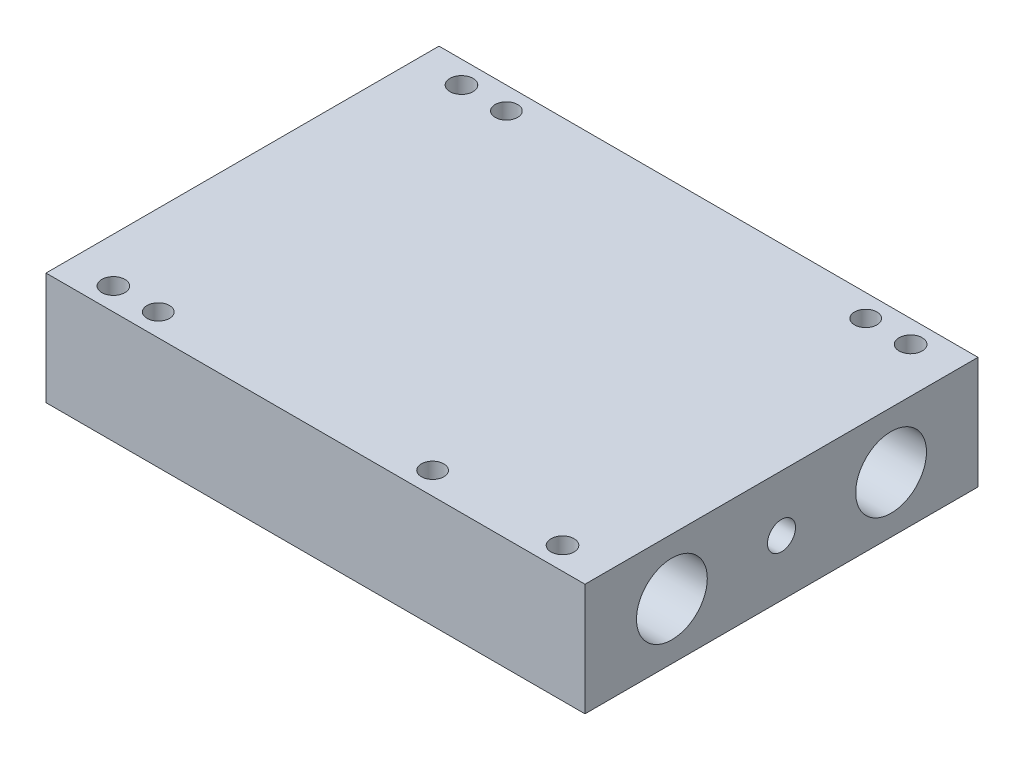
from build123d import *

# Parameters (mm, degrees)
SKETCH1_W                    = 111.125
SKETCH1_H                    = 31.75
EXTRUDE1_DEPTH               = 76.2
F_5_16_18_TAPPED_HOLE1_D     = 6.5278
F_5_16_18_TAPPED_HOLE1_DEPTH = 19.7612
F_5_16_18_TAPPED_HOLE1_TIP   = 1.961148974
HOLE1_D                      = 6.35
SKETCH7_R                    = 10.0076
SKETCH7_R_2                  = 3.96875
CUT_EXTRUDE1_DEPTH           = 163.987628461


with BuildPart() as part:
    # Sketch1 → Extrude1 (new, symmetric)
    with BuildSketch(Plane(origin=(0, 0, 0), x_dir=(0, 0, -1), z_dir=(1, 0, 0))):
        Rectangle(SKETCH1_W, SKETCH1_H)
    extrude(amount=EXTRUDE1_DEPTH, both=True)

    # 5_16-18 Tapped Hole1
    with Locations(Plane(origin=(0, 15.875, 0), x_dir=(1, 0, 0), z_dir=(0, 1, 0))):
        with Locations((-63.5, 49.2125), (63.5, 49.2125), (63.5, -49.2125), (-63.5, -49.2125)):
            Hole(F_5_16_18_TAPPED_HOLE1_D / 2, depth=F_5_16_18_TAPPED_HOLE1_DEPTH)
            with Locations((0, 0, -(F_5_16_18_TAPPED_HOLE1_DEPTH + F_5_16_18_TAPPED_HOLE1_TIP / 2))):  # 118° drill point
                Cone(0, F_5_16_18_TAPPED_HOLE1_D / 2, F_5_16_18_TAPPED_HOLE1_TIP, mode=Mode.SUBTRACT)

    # Hole1 (through all)
    with Locations(Plane(origin=(0, 15.875, 0), x_dir=(1, 0, 0), z_dir=(0, 1, 0))):
        with Locations((-50.8, 49.2125), (-50.8, -49.2125), (50.8, 49.2125), (26.762898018, -49.2125)):
            Hole(HOLE1_D / 2)

    # Sketch7 → Cut-Extrude1 (cut, through all)
    with BuildSketch(Plane(origin=(76.2, 0, 0), x_dir=(0, 0, -1), z_dir=(1, 0, 0))):
        with Locations((-30.988, 0)):
            Circle(SKETCH7_R)
        with Locations((30.988, 0)):
            Circle(SKETCH7_R)
        Circle(SKETCH7_R_2)
    extrude(amount=-CUT_EXTRUDE1_DEPTH, mode=Mode.SUBTRACT)


solid = part.part
